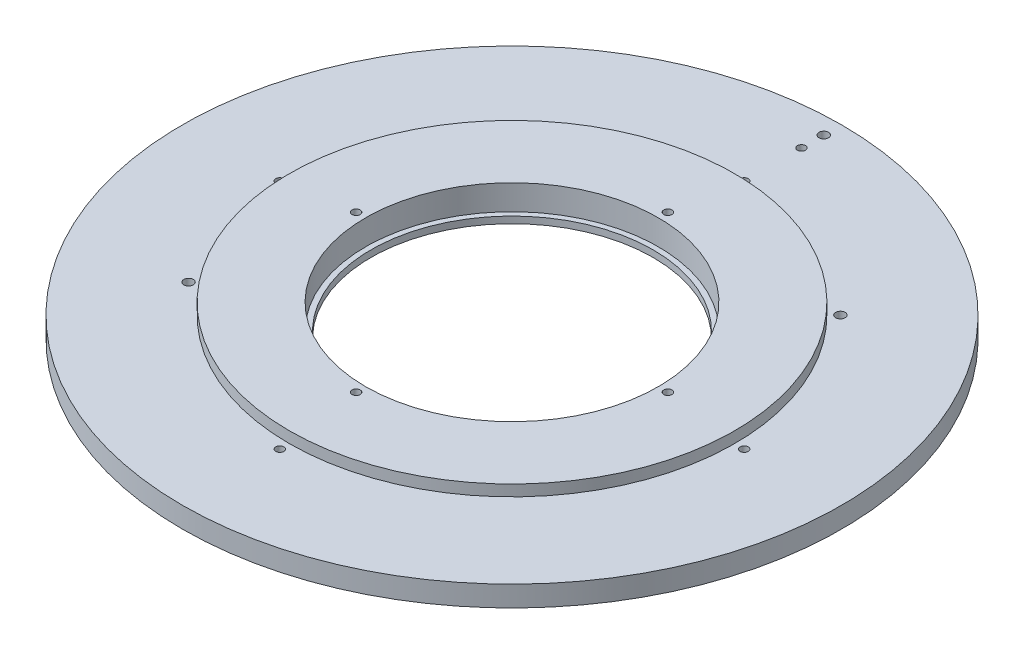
ISO-10303-21;
HEADER;
FILE_DESCRIPTION(('STEP AP214'),'2;1');
FILE_NAME('part.step','',(''),(''),'','','');
FILE_SCHEMA(('AUTOMOTIVE_DESIGN { 1 0 10303 214 1 1 1 1 }'));
ENDSEC;
DATA;
#1=APPLICATION_CONTEXT('core data for automotive mechanical design processes');
#2=APPLICATION_PROTOCOL_DEFINITION('international standard','automotive_design',2000,#1);
#3=PRODUCT_CONTEXT('',#1,'mechanical');
#4=PRODUCT('Part','Part','',(#3));
#5=PRODUCT_RELATED_PRODUCT_CATEGORY('part','',(#4));
#6=PRODUCT_DEFINITION_FORMATION('','',#4);
#7=PRODUCT_DEFINITION_CONTEXT('part definition',#1,'design');
#8=PRODUCT_DEFINITION('design','',#6,#7);
#9=PRODUCT_DEFINITION_SHAPE('','',#8);
#10=(LENGTH_UNIT() NAMED_UNIT(*) SI_UNIT(.MILLI.,.METRE.));
#11=(NAMED_UNIT(*) PLANE_ANGLE_UNIT() SI_UNIT($,.RADIAN.));
#12=(NAMED_UNIT(*) SI_UNIT($,.STERADIAN.) SOLID_ANGLE_UNIT());
#13=UNCERTAINTY_MEASURE_WITH_UNIT(LENGTH_MEASURE(1.E-05),#10,'distance_accuracy_value','');
#14=(GEOMETRIC_REPRESENTATION_CONTEXT(3) GLOBAL_UNCERTAINTY_ASSIGNED_CONTEXT((#13)) GLOBAL_UNIT_ASSIGNED_CONTEXT((#10,
#11,#12)) REPRESENTATION_CONTEXT('',''));
#15=CARTESIAN_POINT('',(0.,0.,0.));
#16=DIRECTION('',(0.,0.,1.));
#17=DIRECTION('',(1.,0.,0.));
#18=AXIS2_PLACEMENT_3D('',#15,#16,#17);
#19=CARTESIAN_POINT('',(0.,1219.2,0.));
#20=DIRECTION('',(0.,-1.,0.));
#21=DIRECTION('',(0.,0.,-1.));
#22=AXIS2_PLACEMENT_3D('',#19,#20,#21);
#23=CYLINDRICAL_SURFACE('',#22,164.457933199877);
#24=CARTESIAN_POINT('',(0.,1203.325,0.));
#25=DIRECTION('',(0.,1.,0.));
#26=DIRECTION('',(0.,0.,1.));
#27=AXIS2_PLACEMENT_3D('',#24,#25,#26);
#28=CIRCLE('',#27,164.457933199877);
#29=CARTESIAN_POINT('',(0.,1203.325,164.457933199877));
#30=VERTEX_POINT('',#29);
#31=EDGE_CURVE('E10',#30,#30,#28,.T.);
#32=ORIENTED_EDGE('',*,*,#31,.T.);
#33=EDGE_LOOP('',(#32));
#34=FACE_BOUND('',#33,.T.);
#35=CARTESIAN_POINT('',(0.,1213.64375,0.));
#36=DIRECTION('',(0.,1.,0.));
#37=DIRECTION('',(0.,0.,1.));
#38=AXIS2_PLACEMENT_3D('',#35,#36,#37);
#39=CIRCLE('',#38,164.457933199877);
#40=CARTESIAN_POINT('',(0.,1213.64375,164.457933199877));
#41=VERTEX_POINT('',#40);
#42=EDGE_CURVE('E41',#41,#41,#39,.T.);
#43=ORIENTED_EDGE('',*,*,#42,.F.);
#44=EDGE_LOOP('',(#43));
#45=FACE_BOUND('',#44,.T.);
#46=ADVANCED_FACE('F34',(#34,#45),#23,.T.);
#47=CARTESIAN_POINT('',(0.,1203.325,0.));
#48=DIRECTION('',(0.,1.,0.));
#49=DIRECTION('',(0.,0.,1.));
#50=AXIS2_PLACEMENT_3D('',#47,#48,#49);
#51=PLANE('',#50);
#52=CARTESIAN_POINT('',(0.,1203.325,-155.575));
#53=DIRECTION('',(0.,1.,0.));
#54=DIRECTION('',(0.,0.,1.));
#55=AXIS2_PLACEMENT_3D('',#52,#53,#54);
#56=CIRCLE('',#55,2.18281250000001);
#57=CARTESIAN_POINT('',(0.,1203.325,-153.3921875));
#58=VERTEX_POINT('',#57);
#59=EDGE_CURVE('E37',#58,#58,#56,.T.);
#60=ORIENTED_EDGE('',*,*,#59,.T.);
#61=EDGE_LOOP('',(#60));
#62=FACE_BOUND('',#61,.T.);
#63=CARTESIAN_POINT('',(0.,1203.325,-144.4625));
#64=DIRECTION('',(0.,1.,0.));
#65=DIRECTION('',(0.,0.,1.));
#66=AXIS2_PLACEMENT_3D('',#63,#64,#65);
#67=CIRCLE('',#66,2.0193);
#68=CARTESIAN_POINT('',(0.,1203.325,-142.4432));
#69=VERTEX_POINT('',#68);
#70=EDGE_CURVE('E65',#69,#69,#67,.T.);
#71=ORIENTED_EDGE('',*,*,#70,.T.);
#72=EDGE_LOOP('',(#71));
#73=FACE_BOUND('',#72,.T.);
#74=CARTESIAN_POINT('',(-94.9294825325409,1203.325,66.4703392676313));
#75=DIRECTION('',(0.,1.,0.));
#76=DIRECTION('',(0.,0.,1.));
#77=AXIS2_PLACEMENT_3D('',#74,#75,#76);
#78=CIRCLE('',#77,2.36855000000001);
#79=CARTESIAN_POINT('',(-94.9294825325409,1203.325,68.8388892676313));
#80=VERTEX_POINT('',#79);
#81=EDGE_CURVE('E72',#80,#80,#78,.T.);
#82=ORIENTED_EDGE('',*,*,#81,.T.);
#83=EDGE_LOOP('',(#82));
#84=FACE_BOUND('',#83,.T.);
#85=CARTESIAN_POINT('',(81.944837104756,1203.325,-81.944837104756));
#86=DIRECTION('',(0.,1.,0.));
#87=DIRECTION('',(0.,0.,1.));
#88=AXIS2_PLACEMENT_3D('',#85,#86,#87);
#89=CIRCLE('',#88,2.36855000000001);
#90=CARTESIAN_POINT('',(81.944837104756,1203.325,-79.576287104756));
#91=VERTEX_POINT('',#90);
#92=EDGE_CURVE('E61',#91,#91,#89,.T.);
#93=ORIENTED_EDGE('',*,*,#92,.T.);
#94=EDGE_LOOP('',(#93));
#95=FACE_BOUND('',#94,.T.);
#96=CARTESIAN_POINT('',(-115.8875,1203.325,0.));
#97=DIRECTION('',(0.,1.,0.));
#98=DIRECTION('',(0.,0.,1.));
#99=AXIS2_PLACEMENT_3D('',#96,#97,#98);
#100=CIRCLE('',#99,2.0193);
#101=CARTESIAN_POINT('',(-115.8875,1203.325,2.0193));
#102=VERTEX_POINT('',#101);
#103=EDGE_CURVE('E89',#102,#102,#100,.T.);
#104=ORIENTED_EDGE('',*,*,#103,.T.);
#105=EDGE_LOOP('',(#104));
#106=FACE_BOUND('',#105,.T.);
#107=CARTESIAN_POINT('',(0.,1203.325,-115.8875));
#108=DIRECTION('',(0.,1.,0.));
#109=DIRECTION('',(0.,0.,1.));
#110=AXIS2_PLACEMENT_3D('',#107,#108,#109);
#111=CIRCLE('',#110,2.0193);
#112=CARTESIAN_POINT('',(0.,1203.325,-113.8682));
#113=VERTEX_POINT('',#112);
#114=EDGE_CURVE('E57',#113,#113,#111,.T.);
#115=ORIENTED_EDGE('',*,*,#114,.T.);
#116=EDGE_LOOP('',(#115));
#117=FACE_BOUND('',#116,.T.);
#118=CARTESIAN_POINT('',(115.8875,1203.325,0.));
#119=DIRECTION('',(0.,1.,0.));
#120=DIRECTION('',(0.,0.,1.));
#121=AXIS2_PLACEMENT_3D('',#118,#119,#120);
#122=CIRCLE('',#121,2.0193);
#123=CARTESIAN_POINT('',(115.8875,1203.325,2.01930000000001));
#124=VERTEX_POINT('',#123);
#125=EDGE_CURVE('E52',#124,#124,#122,.T.);
#126=ORIENTED_EDGE('',*,*,#125,.T.);
#127=EDGE_LOOP('',(#126));
#128=FACE_BOUND('',#127,.T.);
#129=CARTESIAN_POINT('',(0.,1203.325,115.8875));
#130=DIRECTION('',(0.,1.,0.));
#131=DIRECTION('',(0.,0.,1.));
#132=AXIS2_PLACEMENT_3D('',#129,#130,#131);
#133=CIRCLE('',#132,2.0193);
#134=CARTESIAN_POINT('',(0.,1203.325,117.9068));
#135=VERTEX_POINT('',#134);
#136=EDGE_CURVE('E98',#135,#135,#133,.T.);
#137=ORIENTED_EDGE('',*,*,#136,.T.);
#138=EDGE_LOOP('',(#137));
#139=FACE_BOUND('',#138,.T.);
#140=CARTESIAN_POINT('',(0.,1203.325,-77.7875));
#141=DIRECTION('',(0.,1.,0.));
#142=DIRECTION('',(0.,0.,1.));
#143=AXIS2_PLACEMENT_3D('',#140,#141,#142);
#144=CIRCLE('',#143,2.0193);
#145=CARTESIAN_POINT('',(0.,1203.325,-75.7682));
#146=VERTEX_POINT('',#145);
#147=EDGE_CURVE('E104',#146,#146,#144,.T.);
#148=ORIENTED_EDGE('',*,*,#147,.T.);
#149=EDGE_LOOP('',(#148));
#150=FACE_BOUND('',#149,.T.);
#151=CARTESIAN_POINT('',(77.7875,1203.325,0.));
#152=DIRECTION('',(0.,1.,0.));
#153=DIRECTION('',(0.,0.,1.));
#154=AXIS2_PLACEMENT_3D('',#151,#152,#153);
#155=CIRCLE('',#154,2.0193);
#156=CARTESIAN_POINT('',(77.7875,1203.325,2.0193));
#157=VERTEX_POINT('',#156);
#158=EDGE_CURVE('E110',#157,#157,#155,.T.);
#159=ORIENTED_EDGE('',*,*,#158,.T.);
#160=EDGE_LOOP('',(#159));
#161=FACE_BOUND('',#160,.T.);
#162=CARTESIAN_POINT('',(0.,1203.325,77.7875));
#163=DIRECTION('',(0.,1.,0.));
#164=DIRECTION('',(0.,0.,1.));
#165=AXIS2_PLACEMENT_3D('',#162,#163,#164);
#166=CIRCLE('',#165,2.0193);
#167=CARTESIAN_POINT('',(0.,1203.325,79.8068));
#168=VERTEX_POINT('',#167);
#169=EDGE_CURVE('E116',#168,#168,#166,.T.);
#170=ORIENTED_EDGE('',*,*,#169,.T.);
#171=EDGE_LOOP('',(#170));
#172=FACE_BOUND('',#171,.T.);
#173=CARTESIAN_POINT('',(-77.7875,1203.325,0.));
#174=DIRECTION('',(0.,1.,0.));
#175=DIRECTION('',(0.,0.,1.));
#176=AXIS2_PLACEMENT_3D('',#173,#174,#175);
#177=CIRCLE('',#176,2.0193);
#178=CARTESIAN_POINT('',(-77.7875,1203.325,2.0193));
#179=VERTEX_POINT('',#178);
#180=EDGE_CURVE('E122',#179,#179,#177,.T.);
#181=ORIENTED_EDGE('',*,*,#180,.T.);
#182=EDGE_LOOP('',(#181));
#183=FACE_BOUND('',#182,.T.);
#184=CARTESIAN_POINT('',(0.,1203.325,0.));
#185=DIRECTION('',(0.,1.,0.));
#186=DIRECTION('',(0.,0.,1.));
#187=AXIS2_PLACEMENT_3D('',#184,#185,#186);
#188=CIRCLE('',#187,70.4215);
#189=CARTESIAN_POINT('',(0.,1203.325,70.4215));
#190=VERTEX_POINT('',#189);
#191=EDGE_CURVE('E126',#190,#190,#188,.T.);
#192=ORIENTED_EDGE('',*,*,#191,.T.);
#193=EDGE_LOOP('',(#192));
#194=FACE_BOUND('',#193,.T.);
#195=ORIENTED_EDGE('',*,*,#31,.F.);
#196=EDGE_LOOP('',(#195));
#197=FACE_BOUND('',#196,.T.);
#198=ADVANCED_FACE('F155',(#62,#73,#84,#95,#106,#117,#128,#139,#150,#161,#172,#183,#194,#197),
#51,.F.);
#199=CARTESIAN_POINT('',(0.,1213.64375,0.));
#200=DIRECTION('',(0.,1.,0.));
#201=DIRECTION('',(0.,0.,1.));
#202=AXIS2_PLACEMENT_3D('',#199,#200,#201);
#203=PLANE('',#202);
#204=CARTESIAN_POINT('',(0.,1213.64375000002,-155.575));
#205=DIRECTION('',(0.,1.,0.));
#206=DIRECTION('',(0.,0.,1.));
#207=AXIS2_PLACEMENT_3D('',#204,#205,#206);
#208=CIRCLE('',#207,2.39395);
#209=CARTESIAN_POINT('',(0.,1213.64375000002,-153.18105));
#210=VERTEX_POINT('',#209);
#211=EDGE_CURVE('E275',#210,#210,#208,.T.);
#212=ORIENTED_EDGE('',*,*,#211,.F.);
#213=EDGE_LOOP('',(#212));
#214=FACE_BOUND('',#213,.T.);
#215=CARTESIAN_POINT('',(0.,1213.64375000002,-144.4625));
#216=DIRECTION('',(0.,1.,0.));
#217=DIRECTION('',(0.,0.,1.));
#218=AXIS2_PLACEMENT_3D('',#215,#216,#217);
#219=CIRCLE('',#218,2.0193);
#220=CARTESIAN_POINT('',(0.,1213.64375000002,-142.4432));
#221=VERTEX_POINT('',#220);
#222=EDGE_CURVE('E68',#221,#221,#219,.T.);
#223=ORIENTED_EDGE('',*,*,#222,.F.);
#224=EDGE_LOOP('',(#223));
#225=FACE_BOUND('',#224,.T.);
#226=CARTESIAN_POINT('',(-94.9294825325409,1213.64374999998,66.4703392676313));
#227=DIRECTION('',(0.,1.,0.));
#228=DIRECTION('',(0.,0.,1.));
#229=AXIS2_PLACEMENT_3D('',#226,#227,#228);
#230=CIRCLE('',#229,2.36855000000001);
#231=CARTESIAN_POINT('',(-94.9294825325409,1213.64374999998,68.8388892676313));
#232=VERTEX_POINT('',#231);
#233=EDGE_CURVE('E67',#232,#232,#230,.T.);
#234=ORIENTED_EDGE('',*,*,#233,.F.);
#235=EDGE_LOOP('',(#234));
#236=FACE_BOUND('',#235,.T.);
#237=CARTESIAN_POINT('',(81.944837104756,1213.64374999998,-81.944837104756));
#238=DIRECTION('',(0.,1.,0.));
#239=DIRECTION('',(0.,0.,1.));
#240=AXIS2_PLACEMENT_3D('',#237,#238,#239);
#241=CIRCLE('',#240,2.36855000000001);
#242=CARTESIAN_POINT('',(81.944837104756,1213.64374999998,-79.576287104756));
#243=VERTEX_POINT('',#242);
#244=EDGE_CURVE('E64',#243,#243,#241,.T.);
#245=ORIENTED_EDGE('',*,*,#244,.F.);
#246=EDGE_LOOP('',(#245));
#247=FACE_BOUND('',#246,.T.);
#248=CARTESIAN_POINT('',(-115.8875,1213.64374999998,0.));
#249=DIRECTION('',(0.,1.,0.));
#250=DIRECTION('',(0.,0.,1.));
#251=AXIS2_PLACEMENT_3D('',#248,#249,#250);
#252=CIRCLE('',#251,2.0193);
#253=CARTESIAN_POINT('',(-115.8875,1213.64374999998,2.0193));
#254=VERTEX_POINT('',#253);
#255=EDGE_CURVE('E63',#254,#254,#252,.T.);
#256=ORIENTED_EDGE('',*,*,#255,.F.);
#257=EDGE_LOOP('',(#256));
#258=FACE_BOUND('',#257,.T.);
#259=CARTESIAN_POINT('',(0.,1213.64374999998,-115.8875));
#260=DIRECTION('',(0.,1.,0.));
#261=DIRECTION('',(0.,0.,1.));
#262=AXIS2_PLACEMENT_3D('',#259,#260,#261);
#263=CIRCLE('',#262,2.0193);
#264=CARTESIAN_POINT('',(0.,1213.64374999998,-113.8682));
#265=VERTEX_POINT('',#264);
#266=EDGE_CURVE('E60',#265,#265,#263,.T.);
#267=ORIENTED_EDGE('',*,*,#266,.F.);
#268=EDGE_LOOP('',(#267));
#269=FACE_BOUND('',#268,.T.);
#270=CARTESIAN_POINT('',(115.8875,1213.64374999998,0.));
#271=DIRECTION('',(0.,1.,0.));
#272=DIRECTION('',(0.,0.,1.));
#273=AXIS2_PLACEMENT_3D('',#270,#271,#272);
#274=CIRCLE('',#273,2.0193);
#275=CARTESIAN_POINT('',(115.8875,1213.64374999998,2.01930000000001));
#276=VERTEX_POINT('',#275);
#277=EDGE_CURVE('E56',#276,#276,#274,.T.);
#278=ORIENTED_EDGE('',*,*,#277,.F.);
#279=EDGE_LOOP('',(#278));
#280=FACE_BOUND('',#279,.T.);
#281=CARTESIAN_POINT('',(0.,1213.64374999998,115.8875));
#282=DIRECTION('',(0.,1.,0.));
#283=DIRECTION('',(0.,0.,1.));
#284=AXIS2_PLACEMENT_3D('',#281,#282,#283);
#285=CIRCLE('',#284,2.0193);
#286=CARTESIAN_POINT('',(0.,1213.64374999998,117.9068));
#287=VERTEX_POINT('',#286);
#288=EDGE_CURVE('E55',#287,#287,#285,.T.);
#289=ORIENTED_EDGE('',*,*,#288,.F.);
#290=EDGE_LOOP('',(#289));
#291=FACE_BOUND('',#290,.T.);
#292=CARTESIAN_POINT('',(0.,1213.64375,0.));
#293=DIRECTION('',(0.,1.,0.));
#294=DIRECTION('',(0.,0.,1.));
#295=AXIS2_PLACEMENT_3D('',#292,#293,#294);
#296=CIRCLE('',#295,111.125);
#297=CARTESIAN_POINT('',(0.,1213.64375,111.125));
#298=VERTEX_POINT('',#297);
#299=EDGE_CURVE('E46',#298,#298,#296,.T.);
#300=ORIENTED_EDGE('',*,*,#299,.F.);
#301=EDGE_LOOP('',(#300));
#302=FACE_BOUND('',#301,.T.);
#303=ORIENTED_EDGE('',*,*,#42,.T.);
#304=EDGE_LOOP('',(#303));
#305=FACE_BOUND('',#304,.T.);
#306=ADVANCED_FACE('F146',(#214,#225,#236,#247,#258,#269,#280,#291,#302,#305),#203,.T.);
#307=CARTESIAN_POINT('',(0.,1213.64375,0.));
#308=DIRECTION('',(0.,1.,0.));
#309=DIRECTION('',(0.,0.,1.));
#310=AXIS2_PLACEMENT_3D('',#307,#308,#309);
#311=CYLINDRICAL_SURFACE('',#310,111.125);
#312=ORIENTED_EDGE('',*,*,#299,.T.);
#313=EDGE_LOOP('',(#312));
#314=FACE_BOUND('',#313,.T.);
#315=CARTESIAN_POINT('',(0.,1219.2,0.));
#316=DIRECTION('',(0.,1.,0.));
#317=DIRECTION('',(0.,0.,1.));
#318=AXIS2_PLACEMENT_3D('',#315,#316,#317);
#319=CIRCLE('',#318,111.125);
#320=CARTESIAN_POINT('',(0.,1219.2,111.125));
#321=VERTEX_POINT('',#320);
#322=EDGE_CURVE('E49',#321,#321,#319,.T.);
#323=ORIENTED_EDGE('',*,*,#322,.F.);
#324=EDGE_LOOP('',(#323));
#325=FACE_BOUND('',#324,.T.);
#326=ADVANCED_FACE('F144',(#314,#325),#311,.T.);
#327=CARTESIAN_POINT('',(0.,1219.2,0.));
#328=DIRECTION('',(0.,1.,0.));
#329=DIRECTION('',(0.,0.,1.));
#330=AXIS2_PLACEMENT_3D('',#327,#328,#329);
#331=PLANE('',#330);
#332=CARTESIAN_POINT('',(0.,1219.20000000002,-77.7875));
#333=DIRECTION('',(0.,1.,0.));
#334=DIRECTION('',(0.,0.,1.));
#335=AXIS2_PLACEMENT_3D('',#332,#333,#334);
#336=CIRCLE('',#335,2.0193);
#337=CARTESIAN_POINT('',(0.,1219.20000000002,-75.7682));
#338=VERTEX_POINT('',#337);
#339=EDGE_CURVE('E101',#338,#338,#336,.T.);
#340=ORIENTED_EDGE('',*,*,#339,.F.);
#341=EDGE_LOOP('',(#340));
#342=FACE_BOUND('',#341,.T.);
#343=CARTESIAN_POINT('',(77.7875,1219.20000000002,0.));
#344=DIRECTION('',(0.,1.,0.));
#345=DIRECTION('',(0.,0.,1.));
#346=AXIS2_PLACEMENT_3D('',#343,#344,#345);
#347=CIRCLE('',#346,2.0193);
#348=CARTESIAN_POINT('',(77.7875,1219.20000000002,2.0193));
#349=VERTEX_POINT('',#348);
#350=EDGE_CURVE('E107',#349,#349,#347,.T.);
#351=ORIENTED_EDGE('',*,*,#350,.F.);
#352=EDGE_LOOP('',(#351));
#353=FACE_BOUND('',#352,.T.);
#354=CARTESIAN_POINT('',(0.,1219.20000000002,77.7875));
#355=DIRECTION('',(0.,1.,0.));
#356=DIRECTION('',(0.,0.,1.));
#357=AXIS2_PLACEMENT_3D('',#354,#355,#356);
#358=CIRCLE('',#357,2.0193);
#359=CARTESIAN_POINT('',(0.,1219.20000000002,79.8068));
#360=VERTEX_POINT('',#359);
#361=EDGE_CURVE('E113',#360,#360,#358,.T.);
#362=ORIENTED_EDGE('',*,*,#361,.F.);
#363=EDGE_LOOP('',(#362));
#364=FACE_BOUND('',#363,.T.);
#365=CARTESIAN_POINT('',(-77.7875,1219.20000000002,0.));
#366=DIRECTION('',(0.,1.,0.));
#367=DIRECTION('',(0.,0.,1.));
#368=AXIS2_PLACEMENT_3D('',#365,#366,#367);
#369=CIRCLE('',#368,2.0193);
#370=CARTESIAN_POINT('',(-77.7875,1219.20000000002,2.0193));
#371=VERTEX_POINT('',#370);
#372=EDGE_CURVE('E119',#371,#371,#369,.T.);
#373=ORIENTED_EDGE('',*,*,#372,.F.);
#374=EDGE_LOOP('',(#373));
#375=FACE_BOUND('',#374,.T.);
#376=CARTESIAN_POINT('',(0.,1219.2,0.));
#377=DIRECTION('',(0.,1.,0.));
#378=DIRECTION('',(0.,0.,1.));
#379=AXIS2_PLACEMENT_3D('',#376,#377,#378);
#380=CIRCLE('',#379,73.03135);
#381=CARTESIAN_POINT('',(0.,1219.2,73.03135));
#382=VERTEX_POINT('',#381);
#383=EDGE_CURVE('E129',#382,#382,#380,.T.);
#384=ORIENTED_EDGE('',*,*,#383,.F.);
#385=EDGE_LOOP('',(#384));
#386=FACE_BOUND('',#385,.T.);
#387=ORIENTED_EDGE('',*,*,#322,.T.);
#388=EDGE_LOOP('',(#387));
#389=FACE_BOUND('',#388,.T.);
#390=ADVANCED_FACE('F142',(#342,#353,#364,#375,#386,#389),#331,.T.);
#391=CARTESIAN_POINT('',(0.,1206.6524,0.));
#392=DIRECTION('',(0.,1.,0.));
#393=DIRECTION('',(0.,0.,1.));
#394=AXIS2_PLACEMENT_3D('',#391,#392,#393);
#395=CYLINDRICAL_SURFACE('',#394,73.03135);
#396=CARTESIAN_POINT('',(0.,1206.6524,0.));
#397=DIRECTION('',(0.,1.,0.));
#398=DIRECTION('',(0.,0.,1.));
#399=AXIS2_PLACEMENT_3D('',#396,#397,#398);
#400=CIRCLE('',#399,73.03135);
#401=CARTESIAN_POINT('',(0.,1206.6524,73.03135));
#402=VERTEX_POINT('',#401);
#403=EDGE_CURVE('E132',#402,#402,#400,.T.);
#404=CARTESIAN_POINT('',(0.,1206.6524,73.03135));
#405=CARTESIAN_POINT('',(0.,1206.78310416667,73.03135));
#406=CARTESIAN_POINT('',(0.,1206.91380833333,73.03135));
#407=CARTESIAN_POINT('',(0.,1207.17521666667,73.03135));
#408=CARTESIAN_POINT('',(0.,1207.30592083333,73.03135));
#409=CARTESIAN_POINT('',(0.,1207.56732916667,73.03135));
#410=CARTESIAN_POINT('',(0.,1207.69803333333,73.03135));
#411=CARTESIAN_POINT('',(0.,1207.95944166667,73.03135));
#412=CARTESIAN_POINT('',(0.,1208.09014583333,73.03135));
#413=CARTESIAN_POINT('',(0.,1208.35155416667,73.03135));
#414=CARTESIAN_POINT('',(0.,1208.48225833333,73.03135));
#415=CARTESIAN_POINT('',(0.,1208.74366666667,73.03135));
#416=CARTESIAN_POINT('',(0.,1208.87437083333,73.03135));
#417=CARTESIAN_POINT('',(0.,1209.13577916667,73.03135));
#418=CARTESIAN_POINT('',(0.,1209.26648333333,73.03135));
#419=CARTESIAN_POINT('',(0.,1209.52789166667,73.03135));
#420=CARTESIAN_POINT('',(0.,1209.65859583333,73.03135));
#421=CARTESIAN_POINT('',(0.,1209.92000416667,73.03135));
#422=CARTESIAN_POINT('',(0.,1210.05070833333,73.03135));
#423=CARTESIAN_POINT('',(0.,1210.31211666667,73.03135));
#424=CARTESIAN_POINT('',(0.,1210.44282083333,73.03135));
#425=CARTESIAN_POINT('',(0.,1210.70422916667,73.03135));
#426=CARTESIAN_POINT('',(0.,1210.83493333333,73.03135));
#427=CARTESIAN_POINT('',(0.,1211.09634166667,73.03135));
#428=CARTESIAN_POINT('',(0.,1211.22704583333,73.03135));
#429=CARTESIAN_POINT('',(0.,1211.48845416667,73.03135));
#430=CARTESIAN_POINT('',(0.,1211.61915833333,73.03135));
#431=CARTESIAN_POINT('',(0.,1211.88056666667,73.03135));
#432=CARTESIAN_POINT('',(0.,1212.01127083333,73.03135));
#433=CARTESIAN_POINT('',(0.,1212.27267916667,73.03135));
#434=CARTESIAN_POINT('',(0.,1212.40338333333,73.03135));
#435=CARTESIAN_POINT('',(0.,1212.66479166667,73.03135));
#436=CARTESIAN_POINT('',(0.,1212.79549583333,73.03135));
#437=CARTESIAN_POINT('',(0.,1213.05690416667,73.03135));
#438=CARTESIAN_POINT('',(0.,1213.18760833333,73.03135));
#439=CARTESIAN_POINT('',(0.,1213.44901666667,73.03135));
#440=CARTESIAN_POINT('',(0.,1213.57972083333,73.03135));
#441=CARTESIAN_POINT('',(0.,1213.84112916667,73.03135));
#442=CARTESIAN_POINT('',(0.,1213.97183333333,73.03135));
#443=CARTESIAN_POINT('',(0.,1214.23324166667,73.03135));
#444=CARTESIAN_POINT('',(0.,1214.36394583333,73.03135));
#445=CARTESIAN_POINT('',(0.,1214.62535416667,73.03135));
#446=CARTESIAN_POINT('',(0.,1214.75605833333,73.03135));
#447=CARTESIAN_POINT('',(0.,1215.01746666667,73.03135));
#448=CARTESIAN_POINT('',(0.,1215.14817083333,73.03135));
#449=CARTESIAN_POINT('',(0.,1215.40957916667,73.03135));
#450=CARTESIAN_POINT('',(0.,1215.54028333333,73.03135));
#451=CARTESIAN_POINT('',(0.,1215.80169166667,73.03135));
#452=CARTESIAN_POINT('',(0.,1215.93239583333,73.03135));
#453=CARTESIAN_POINT('',(0.,1216.19380416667,73.03135));
#454=CARTESIAN_POINT('',(0.,1216.32450833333,73.03135));
#455=CARTESIAN_POINT('',(0.,1216.58591666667,73.03135));
#456=CARTESIAN_POINT('',(0.,1216.71662083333,73.03135));
#457=CARTESIAN_POINT('',(0.,1216.97802916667,73.03135));
#458=CARTESIAN_POINT('',(0.,1217.10873333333,73.03135));
#459=CARTESIAN_POINT('',(0.,1217.37014166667,73.03135));
#460=CARTESIAN_POINT('',(0.,1217.50084583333,73.03135));
#461=CARTESIAN_POINT('',(0.,1217.76225416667,73.03135));
#462=CARTESIAN_POINT('',(0.,1217.89295833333,73.03135));
#463=CARTESIAN_POINT('',(0.,1218.15436666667,73.03135));
#464=CARTESIAN_POINT('',(0.,1218.28507083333,73.03135));
#465=CARTESIAN_POINT('',(0.,1218.54647916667,73.03135));
#466=CARTESIAN_POINT('',(0.,1218.67718333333,73.03135));
#467=CARTESIAN_POINT('',(0.,1218.93859166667,73.03135));
#468=CARTESIAN_POINT('',(0.,1219.06929583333,73.03135));
#469=CARTESIAN_POINT('',(0.,1219.2,73.03135));
#470=B_SPLINE_CURVE_WITH_KNOTS('',3,(#404,#405,#406,#407,#408,#409,#410,#411,#412,#413,#414,
#415,#416,#417,#418,#419,#420,#421,#422,#423,#424,#425,#426,#427,#428,#429,#430,#431,#432,#433,
#434,#435,#436,#437,#438,#439,#440,#441,#442,#443,#444,#445,#446,#447,#448,#449,#450,#451,#452,
#453,#454,#455,#456,#457,#458,#459,#460,#461,#462,#463,#464,#465,#466,#467,#468,#469),
.UNSPECIFIED.,.F.,.F.,(4,2,2,2,2,2,2,2,2,2,2,2,2,2,2,2,2,2,2,2,2,2,2,2,2,2,2,2,2,2,2,2,4),(0.,
0.392112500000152,0.784225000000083,1.17633750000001,1.56845000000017,1.9605625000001,
2.35267500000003,2.74478750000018,3.13690000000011,3.52901250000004,3.92112500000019,
4.31323750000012,4.70535000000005,5.0974625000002,5.48957500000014,5.88168750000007,
6.27380000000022,6.66591250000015,7.05802500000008,7.45013750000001,7.84225000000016,
8.23436250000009,8.62647500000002,9.01858750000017,9.41070000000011,9.80281250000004,
10.1949250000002,10.5870375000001,10.97915,11.3712625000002,11.7633750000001,12.1554875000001,
12.5476000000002),.UNSPECIFIED.);
#471=EDGE_CURVE('BSEAM152',#402,#382,#470,.T.);
#472=ORIENTED_EDGE('',*,*,#403,.F.);
#473=ORIENTED_EDGE('',*,*,#383,.T.);
#474=ORIENTED_EDGE('',*,*,#471,.T.);
#475=ORIENTED_EDGE('',*,*,#471,.F.);
#476=EDGE_LOOP('',(#472,#474,#473,#475));
#477=FACE_BOUND('',#476,.T.);
#478=ADVANCED_FACE('F152',(#477),#395,.F.);
#479=CARTESIAN_POINT('',(0.,1206.6524,0.));
#480=DIRECTION('',(0.,1.,0.));
#481=DIRECTION('',(0.,0.,1.));
#482=AXIS2_PLACEMENT_3D('',#479,#480,#481);
#483=PLANE('',#482);
#484=CARTESIAN_POINT('',(0.,1206.6524,0.));
#485=DIRECTION('',(0.,1.,0.));
#486=DIRECTION('',(0.,0.,1.));
#487=AXIS2_PLACEMENT_3D('',#484,#485,#486);
#488=CIRCLE('',#487,70.4215);
#489=CARTESIAN_POINT('',(0.,1206.6524,70.4215));
#490=VERTEX_POINT('',#489);
#491=EDGE_CURVE('E125',#490,#490,#488,.T.);
#492=ORIENTED_EDGE('',*,*,#491,.F.);
#493=EDGE_LOOP('',(#492));
#494=FACE_BOUND('',#493,.T.);
#495=ORIENTED_EDGE('',*,*,#403,.T.);
#496=EDGE_LOOP('',(#495));
#497=FACE_BOUND('',#496,.T.);
#498=ADVANCED_FACE('F198',(#494,#497),#483,.T.);
#499=CARTESIAN_POINT('',(0.,1203.325,0.));
#500=DIRECTION('',(0.,1.,0.));
#501=DIRECTION('',(0.,0.,1.));
#502=AXIS2_PLACEMENT_3D('',#499,#500,#501);
#503=CYLINDRICAL_SURFACE('',#502,70.4215);
#504=CARTESIAN_POINT('',(0.,1203.325,70.4215));
#505=CARTESIAN_POINT('',(0.,1203.35966041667,70.4215));
#506=CARTESIAN_POINT('',(0.,1203.39432083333,70.4215));
#507=CARTESIAN_POINT('',(0.,1203.46364166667,70.4215));
#508=CARTESIAN_POINT('',(0.,1203.49830208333,70.4215));
#509=CARTESIAN_POINT('',(0.,1203.56762291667,70.4215));
#510=CARTESIAN_POINT('',(0.,1203.60228333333,70.4215));
#511=CARTESIAN_POINT('',(0.,1203.67160416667,70.4215));
#512=CARTESIAN_POINT('',(0.,1203.70626458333,70.4215));
#513=CARTESIAN_POINT('',(0.,1203.77558541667,70.4215));
#514=CARTESIAN_POINT('',(0.,1203.81024583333,70.4215));
#515=CARTESIAN_POINT('',(0.,1203.87956666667,70.4215));
#516=CARTESIAN_POINT('',(0.,1203.91422708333,70.4215));
#517=CARTESIAN_POINT('',(0.,1203.98354791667,70.4215));
#518=CARTESIAN_POINT('',(0.,1204.01820833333,70.4215));
#519=CARTESIAN_POINT('',(0.,1204.08752916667,70.4215));
#520=CARTESIAN_POINT('',(0.,1204.12218958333,70.4215));
#521=CARTESIAN_POINT('',(0.,1204.19151041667,70.4215));
#522=CARTESIAN_POINT('',(0.,1204.22617083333,70.4215));
#523=CARTESIAN_POINT('',(0.,1204.29549166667,70.4215));
#524=CARTESIAN_POINT('',(0.,1204.33015208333,70.4215));
#525=CARTESIAN_POINT('',(0.,1204.39947291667,70.4215));
#526=CARTESIAN_POINT('',(0.,1204.43413333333,70.4215));
#527=CARTESIAN_POINT('',(0.,1204.50345416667,70.4215));
#528=CARTESIAN_POINT('',(0.,1204.53811458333,70.4215));
#529=CARTESIAN_POINT('',(0.,1204.60743541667,70.4215));
#530=CARTESIAN_POINT('',(0.,1204.64209583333,70.4215));
#531=CARTESIAN_POINT('',(0.,1204.71141666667,70.4215));
#532=CARTESIAN_POINT('',(0.,1204.74607708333,70.4215));
#533=CARTESIAN_POINT('',(0.,1204.81539791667,70.4215));
#534=CARTESIAN_POINT('',(0.,1204.85005833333,70.4215));
#535=CARTESIAN_POINT('',(0.,1204.91937916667,70.4215));
#536=CARTESIAN_POINT('',(0.,1204.95403958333,70.4215));
#537=CARTESIAN_POINT('',(0.,1205.02336041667,70.4215));
#538=CARTESIAN_POINT('',(0.,1205.05802083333,70.4215));
#539=CARTESIAN_POINT('',(0.,1205.12734166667,70.4215));
#540=CARTESIAN_POINT('',(0.,1205.16200208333,70.4215));
#541=CARTESIAN_POINT('',(0.,1205.23132291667,70.4215));
#542=CARTESIAN_POINT('',(0.,1205.26598333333,70.4215));
#543=CARTESIAN_POINT('',(0.,1205.33530416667,70.4215));
#544=CARTESIAN_POINT('',(0.,1205.36996458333,70.4215));
#545=CARTESIAN_POINT('',(0.,1205.43928541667,70.4215));
#546=CARTESIAN_POINT('',(0.,1205.47394583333,70.4215));
#547=CARTESIAN_POINT('',(0.,1205.54326666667,70.4215));
#548=CARTESIAN_POINT('',(0.,1205.57792708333,70.4215));
#549=CARTESIAN_POINT('',(0.,1205.64724791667,70.4215));
#550=CARTESIAN_POINT('',(0.,1205.68190833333,70.4215));
#551=CARTESIAN_POINT('',(0.,1205.75122916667,70.4215));
#552=CARTESIAN_POINT('',(0.,1205.78588958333,70.4215));
#553=CARTESIAN_POINT('',(0.,1205.85521041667,70.4215));
#554=CARTESIAN_POINT('',(0.,1205.88987083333,70.4215));
#555=CARTESIAN_POINT('',(0.,1205.95919166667,70.4215));
#556=CARTESIAN_POINT('',(0.,1205.99385208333,70.4215));
#557=CARTESIAN_POINT('',(0.,1206.06317291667,70.4215));
#558=CARTESIAN_POINT('',(0.,1206.09783333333,70.4215));
#559=CARTESIAN_POINT('',(0.,1206.16715416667,70.4215));
#560=CARTESIAN_POINT('',(0.,1206.20181458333,70.4215));
#561=CARTESIAN_POINT('',(0.,1206.27113541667,70.4215));
#562=CARTESIAN_POINT('',(0.,1206.30579583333,70.4215));
#563=CARTESIAN_POINT('',(0.,1206.37511666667,70.4215));
#564=CARTESIAN_POINT('',(0.,1206.40977708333,70.4215));
#565=CARTESIAN_POINT('',(0.,1206.47909791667,70.4215));
#566=CARTESIAN_POINT('',(0.,1206.51375833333,70.4215));
#567=CARTESIAN_POINT('',(0.,1206.58307916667,70.4215));
#568=CARTESIAN_POINT('',(0.,1206.61773958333,70.4215));
#569=CARTESIAN_POINT('',(0.,1206.6524,70.4215));
#570=B_SPLINE_CURVE_WITH_KNOTS('',3,(#504,#505,#506,#507,#508,#509,#510,#511,#512,#513,#514,
#515,#516,#517,#518,#519,#520,#521,#522,#523,#524,#525,#526,#527,#528,#529,#530,#531,#532,#533,
#534,#535,#536,#537,#538,#539,#540,#541,#542,#543,#544,#545,#546,#547,#548,#549,#550,#551,#552,
#553,#554,#555,#556,#557,#558,#559,#560,#561,#562,#563,#564,#565,#566,#567,#568,#569),
.UNSPECIFIED.,.F.,.F.,(4,2,2,2,2,2,2,2,2,2,2,2,2,2,2,2,2,2,2,2,2,2,2,2,2,2,2,2,2,2,2,2,4),(0.,
0.103981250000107,0.207962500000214,0.311943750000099,0.415925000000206,0.519906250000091,
0.623887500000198,0.727868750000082,0.831850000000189,0.935831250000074,1.03981250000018,
1.14379375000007,1.24777500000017,1.35175625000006,1.45573750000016,1.55971875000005,
1.66370000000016,1.76768125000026,1.87166250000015,1.97564375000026,2.07962500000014,
2.18360625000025,2.28758750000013,2.39156875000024,2.49555000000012,2.59953125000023,
2.70351250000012,2.80749375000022,2.91147500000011,3.01545625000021,3.1194375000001,
3.22341875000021,3.32740000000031),.UNSPECIFIED.);
#571=EDGE_CURVE('BSEAM194',#190,#490,#570,.T.);
#572=ORIENTED_EDGE('',*,*,#191,.F.);
#573=ORIENTED_EDGE('',*,*,#491,.T.);
#574=ORIENTED_EDGE('',*,*,#571,.T.);
#575=ORIENTED_EDGE('',*,*,#571,.F.);
#576=EDGE_LOOP('',(#572,#574,#573,#575));
#577=FACE_BOUND('',#576,.T.);
#578=ADVANCED_FACE('F194',(#577),#503,.F.);
#579=CARTESIAN_POINT('',(-77.7875,1219.20000000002,0.));
#580=DIRECTION('',(0.,1.,0.));
#581=DIRECTION('',(0.,0.,1.));
#582=AXIS2_PLACEMENT_3D('',#579,#580,#581);
#583=CYLINDRICAL_SURFACE('',#582,2.0193);
#584=ORIENTED_EDGE('',*,*,#372,.T.);
#585=EDGE_LOOP('',(#584));
#586=FACE_BOUND('',#585,.T.);
#587=ORIENTED_EDGE('',*,*,#180,.F.);
#588=EDGE_LOOP('',(#587));
#589=FACE_BOUND('',#588,.T.);
#590=ADVANCED_FACE('F197',(#586,#589),#583,.F.);
#591=CARTESIAN_POINT('',(0.,1219.20000000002,77.7875));
#592=DIRECTION('',(0.,1.,0.));
#593=DIRECTION('',(0.,0.,1.));
#594=AXIS2_PLACEMENT_3D('',#591,#592,#593);
#595=CYLINDRICAL_SURFACE('',#594,2.0193);
#596=ORIENTED_EDGE('',*,*,#361,.T.);
#597=EDGE_LOOP('',(#596));
#598=FACE_BOUND('',#597,.T.);
#599=ORIENTED_EDGE('',*,*,#169,.F.);
#600=EDGE_LOOP('',(#599));
#601=FACE_BOUND('',#600,.T.);
#602=ADVANCED_FACE('F216',(#598,#601),#595,.F.);
#603=CARTESIAN_POINT('',(77.7875,1219.20000000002,0.));
#604=DIRECTION('',(0.,1.,0.));
#605=DIRECTION('',(0.,0.,1.));
#606=AXIS2_PLACEMENT_3D('',#603,#604,#605);
#607=CYLINDRICAL_SURFACE('',#606,2.0193);
#608=ORIENTED_EDGE('',*,*,#350,.T.);
#609=EDGE_LOOP('',(#608));
#610=FACE_BOUND('',#609,.T.);
#611=ORIENTED_EDGE('',*,*,#158,.F.);
#612=EDGE_LOOP('',(#611));
#613=FACE_BOUND('',#612,.T.);
#614=ADVANCED_FACE('F220',(#610,#613),#607,.F.);
#615=CARTESIAN_POINT('',(0.,1219.20000000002,-77.7875));
#616=DIRECTION('',(0.,1.,0.));
#617=DIRECTION('',(0.,0.,1.));
#618=AXIS2_PLACEMENT_3D('',#615,#616,#617);
#619=CYLINDRICAL_SURFACE('',#618,2.0193);
#620=ORIENTED_EDGE('',*,*,#339,.T.);
#621=EDGE_LOOP('',(#620));
#622=FACE_BOUND('',#621,.T.);
#623=ORIENTED_EDGE('',*,*,#147,.F.);
#624=EDGE_LOOP('',(#623));
#625=FACE_BOUND('',#624,.T.);
#626=ADVANCED_FACE('F224',(#622,#625),#619,.F.);
#627=CARTESIAN_POINT('',(0.,1213.64374999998,115.8875));
#628=DIRECTION('',(0.,1.,0.));
#629=DIRECTION('',(0.,0.,1.));
#630=AXIS2_PLACEMENT_3D('',#627,#628,#629);
#631=CYLINDRICAL_SURFACE('',#630,2.0193);
#632=ORIENTED_EDGE('',*,*,#288,.T.);
#633=EDGE_LOOP('',(#632));
#634=FACE_BOUND('',#633,.T.);
#635=ORIENTED_EDGE('',*,*,#136,.F.);
#636=EDGE_LOOP('',(#635));
#637=FACE_BOUND('',#636,.T.);
#638=ADVANCED_FACE('F228',(#634,#637),#631,.F.);
#639=CARTESIAN_POINT('',(115.8875,1213.64374999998,0.));
#640=DIRECTION('',(0.,1.,0.));
#641=DIRECTION('',(0.,0.,1.));
#642=AXIS2_PLACEMENT_3D('',#639,#640,#641);
#643=CYLINDRICAL_SURFACE('',#642,2.0193);
#644=ORIENTED_EDGE('',*,*,#277,.T.);
#645=EDGE_LOOP('',(#644));
#646=FACE_BOUND('',#645,.T.);
#647=ORIENTED_EDGE('',*,*,#125,.F.);
#648=EDGE_LOOP('',(#647));
#649=FACE_BOUND('',#648,.T.);
#650=ADVANCED_FACE('F232',(#646,#649),#643,.F.);
#651=CARTESIAN_POINT('',(0.,1213.64374999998,-115.8875));
#652=DIRECTION('',(0.,1.,0.));
#653=DIRECTION('',(0.,0.,1.));
#654=AXIS2_PLACEMENT_3D('',#651,#652,#653);
#655=CYLINDRICAL_SURFACE('',#654,2.0193);
#656=ORIENTED_EDGE('',*,*,#266,.T.);
#657=EDGE_LOOP('',(#656));
#658=FACE_BOUND('',#657,.T.);
#659=ORIENTED_EDGE('',*,*,#114,.F.);
#660=EDGE_LOOP('',(#659));
#661=FACE_BOUND('',#660,.T.);
#662=ADVANCED_FACE('F236',(#658,#661),#655,.F.);
#663=CARTESIAN_POINT('',(-115.8875,1213.64374999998,0.));
#664=DIRECTION('',(0.,1.,0.));
#665=DIRECTION('',(0.,0.,1.));
#666=AXIS2_PLACEMENT_3D('',#663,#664,#665);
#667=CYLINDRICAL_SURFACE('',#666,2.0193);
#668=ORIENTED_EDGE('',*,*,#255,.T.);
#669=EDGE_LOOP('',(#668));
#670=FACE_BOUND('',#669,.T.);
#671=ORIENTED_EDGE('',*,*,#103,.F.);
#672=EDGE_LOOP('',(#671));
#673=FACE_BOUND('',#672,.T.);
#674=ADVANCED_FACE('F240',(#670,#673),#667,.F.);
#675=CARTESIAN_POINT('',(81.944837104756,1213.64374999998,-81.944837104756));
#676=DIRECTION('',(0.,1.,0.));
#677=DIRECTION('',(0.,0.,1.));
#678=AXIS2_PLACEMENT_3D('',#675,#676,#677);
#679=CYLINDRICAL_SURFACE('',#678,2.36855000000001);
#680=ORIENTED_EDGE('',*,*,#244,.T.);
#681=EDGE_LOOP('',(#680));
#682=FACE_BOUND('',#681,.T.);
#683=ORIENTED_EDGE('',*,*,#92,.F.);
#684=EDGE_LOOP('',(#683));
#685=FACE_BOUND('',#684,.T.);
#686=ADVANCED_FACE('F244',(#682,#685),#679,.F.);
#687=CARTESIAN_POINT('',(-94.9294825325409,1213.64374999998,66.4703392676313));
#688=DIRECTION('',(0.,1.,0.));
#689=DIRECTION('',(0.,0.,1.));
#690=AXIS2_PLACEMENT_3D('',#687,#688,#689);
#691=CYLINDRICAL_SURFACE('',#690,2.36855000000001);
#692=ORIENTED_EDGE('',*,*,#233,.T.);
#693=EDGE_LOOP('',(#692));
#694=FACE_BOUND('',#693,.T.);
#695=ORIENTED_EDGE('',*,*,#81,.F.);
#696=EDGE_LOOP('',(#695));
#697=FACE_BOUND('',#696,.T.);
#698=ADVANCED_FACE('F248',(#694,#697),#691,.F.);
#699=CARTESIAN_POINT('',(0.,1213.64375000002,-144.4625));
#700=DIRECTION('',(0.,1.,0.));
#701=DIRECTION('',(0.,0.,1.));
#702=AXIS2_PLACEMENT_3D('',#699,#700,#701);
#703=CYLINDRICAL_SURFACE('',#702,2.0193);
#704=ORIENTED_EDGE('',*,*,#222,.T.);
#705=EDGE_LOOP('',(#704));
#706=FACE_BOUND('',#705,.T.);
#707=ORIENTED_EDGE('',*,*,#70,.F.);
#708=EDGE_LOOP('',(#707));
#709=FACE_BOUND('',#708,.T.);
#710=ADVANCED_FACE('F252',(#706,#709),#703,.F.);
#711=CARTESIAN_POINT('',(0.,1213.64375000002,-155.575));
#712=DIRECTION('',(0.,1.,0.));
#713=DIRECTION('',(0.,0.,1.));
#714=AXIS2_PLACEMENT_3D('',#711,#712,#713);
#715=CYLINDRICAL_SURFACE('',#714,2.18281250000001);
#716=CARTESIAN_POINT('',(0.,1206.50000000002,-155.575));
#717=DIRECTION('',(0.,1.,0.));
#718=DIRECTION('',(0.,0.,1.));
#719=AXIS2_PLACEMENT_3D('',#716,#717,#718);
#720=CIRCLE('',#719,2.18281250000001);
#721=CARTESIAN_POINT('',(0.,1206.50000000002,-153.3921875));
#722=VERTEX_POINT('',#721);
#723=EDGE_CURVE('E79',#722,#722,#720,.T.);
#724=ORIENTED_EDGE('',*,*,#723,.T.);
#725=EDGE_LOOP('',(#724));
#726=FACE_BOUND('',#725,.T.);
#727=ORIENTED_EDGE('',*,*,#59,.F.);
#728=EDGE_LOOP('',(#727));
#729=FACE_BOUND('',#728,.T.);
#730=ADVANCED_FACE('F256',(#726,#729),#715,.F.);
#731=CARTESIAN_POINT('',(2.18281250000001,1206.50000000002,-155.575));
#732=DIRECTION('',(0.,-1.,0.));
#733=DIRECTION('',(0.,0.,-1.));
#734=AXIS2_PLACEMENT_3D('',#731,#732,#733);
#735=PLANE('',#734);
#736=ORIENTED_EDGE('',*,*,#723,.F.);
#737=EDGE_LOOP('',(#736));
#738=FACE_BOUND('',#737,.T.);
#739=CARTESIAN_POINT('',(0.,1206.50000000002,-155.575));
#740=DIRECTION('',(0.,1.,0.));
#741=DIRECTION('',(0.,0.,1.));
#742=AXIS2_PLACEMENT_3D('',#739,#740,#741);
#743=CIRCLE('',#742,2.39395);
#744=CARTESIAN_POINT('',(0.,1206.50000000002,-153.18105));
#745=VERTEX_POINT('',#744);
#746=EDGE_CURVE('E272',#745,#745,#743,.T.);
#747=ORIENTED_EDGE('',*,*,#746,.T.);
#748=EDGE_LOOP('',(#747));
#749=FACE_BOUND('',#748,.T.);
#750=ADVANCED_FACE('F259',(#738,#749),#735,.F.);
#751=CARTESIAN_POINT('',(0.,1213.64375000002,-155.575));
#752=DIRECTION('',(0.,1.,0.));
#753=DIRECTION('',(0.,0.,1.));
#754=AXIS2_PLACEMENT_3D('',#751,#752,#753);
#755=CYLINDRICAL_SURFACE('',#754,2.39395);
#756=ORIENTED_EDGE('',*,*,#746,.F.);
#757=EDGE_LOOP('',(#756));
#758=FACE_BOUND('',#757,.T.);
#759=ORIENTED_EDGE('',*,*,#211,.T.);
#760=EDGE_LOOP('',(#759));
#761=FACE_BOUND('',#760,.T.);
#762=ADVANCED_FACE('F263',(#758,#761),#755,.F.);
#763=CLOSED_SHELL('',(#46,#198,#306,#326,#390,#478,#498,#578,#590,#602,#614,#626,#638,#650,#662,
#674,#686,#698,#710,#730,#750,#762));
#764=MANIFOLD_SOLID_BREP('B2',#763);
#765=ADVANCED_BREP_SHAPE_REPRESENTATION('',(#18,#764),#14);
#766=SHAPE_DEFINITION_REPRESENTATION(#9,#765);
ENDSEC;
END-ISO-10303-21;
